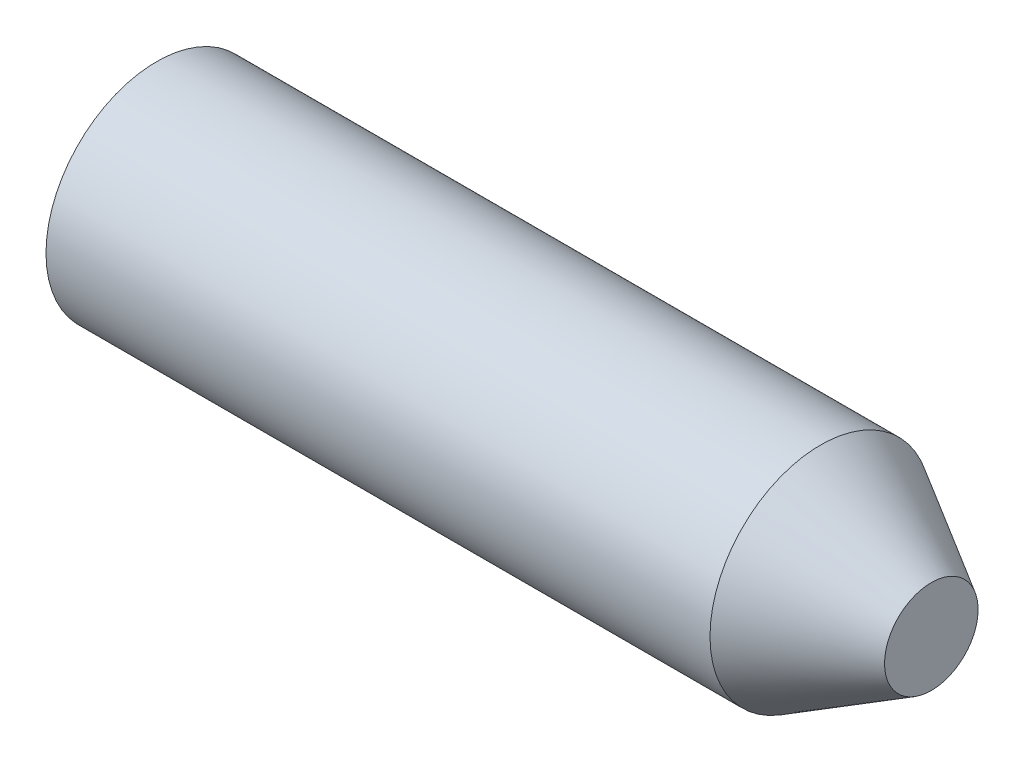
ISO-10303-21;
HEADER;
FILE_DESCRIPTION(('STEP AP214'),'2;1');
FILE_NAME('part.step','',(''),(''),'','','');
FILE_SCHEMA(('AUTOMOTIVE_DESIGN { 1 0 10303 214 1 1 1 1 }'));
ENDSEC;
DATA;
#1=APPLICATION_CONTEXT('core data for automotive mechanical design processes');
#2=APPLICATION_PROTOCOL_DEFINITION('international standard','automotive_design',2000,#1);
#3=PRODUCT_CONTEXT('',#1,'mechanical');
#4=PRODUCT('Part','Part','',(#3));
#5=PRODUCT_RELATED_PRODUCT_CATEGORY('part','',(#4));
#6=PRODUCT_DEFINITION_FORMATION('','',#4);
#7=PRODUCT_DEFINITION_CONTEXT('part definition',#1,'design');
#8=PRODUCT_DEFINITION('design','',#6,#7);
#9=PRODUCT_DEFINITION_SHAPE('','',#8);
#10=(LENGTH_UNIT() NAMED_UNIT(*) SI_UNIT(.MILLI.,.METRE.));
#11=(NAMED_UNIT(*) PLANE_ANGLE_UNIT() SI_UNIT($,.RADIAN.));
#12=(NAMED_UNIT(*) SI_UNIT($,.STERADIAN.) SOLID_ANGLE_UNIT());
#13=UNCERTAINTY_MEASURE_WITH_UNIT(LENGTH_MEASURE(1.E-05),#10,'distance_accuracy_value','');
#14=(GEOMETRIC_REPRESENTATION_CONTEXT(3) GLOBAL_UNCERTAINTY_ASSIGNED_CONTEXT((#13)) GLOBAL_UNIT_ASSIGNED_CONTEXT((#10,
#11,#12)) REPRESENTATION_CONTEXT('',''));
#15=CARTESIAN_POINT('',(0.,0.,0.));
#16=DIRECTION('',(0.,0.,1.));
#17=DIRECTION('',(1.,0.,0.));
#18=AXIS2_PLACEMENT_3D('',#15,#16,#17);
#19=CARTESIAN_POINT('',(0.,20.,0.));
#20=DIRECTION('',(1.,0.,0.));
#21=DIRECTION('',(0.,0.,-1.));
#22=AXIS2_PLACEMENT_3D('',#19,#20,#21);
#23=PLANE('',#22);
#24=CARTESIAN_POINT('',(0.,10.,0.));
#25=DIRECTION('',(-1.,0.,0.));
#26=DIRECTION('',(0.,0.,1.));
#27=AXIS2_PLACEMENT_3D('',#24,#25,#26);
#28=CIRCLE('',#27,7.99999999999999);
#29=CARTESIAN_POINT('',(0.,10.,7.99999999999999));
#30=VERTEX_POINT('',#29);
#31=EDGE_CURVE('E63',#30,#30,#28,.T.);
#32=ORIENTED_EDGE('',*,*,#31,.F.);
#33=EDGE_LOOP('',(#32));
#34=FACE_BOUND('',#33,.T.);
#35=CARTESIAN_POINT('',(0.,10.,0.));
#36=DIRECTION('',(-1.,0.,0.));
#37=DIRECTION('',(0.,0.,1.));
#38=AXIS2_PLACEMENT_3D('',#35,#36,#37);
#39=CIRCLE('',#38,10.);
#40=CARTESIAN_POINT('',(0.,10.,10.));
#41=VERTEX_POINT('',#40);
#42=EDGE_CURVE('E71',#41,#41,#39,.T.);
#43=ORIENTED_EDGE('',*,*,#42,.T.);
#44=EDGE_LOOP('',(#43));
#45=FACE_BOUND('',#44,.T.);
#46=ADVANCED_FACE('F37',(#34,#45),#23,.F.);
#47=CARTESIAN_POINT('',(70.,10.,0.));
#48=DIRECTION('',(-1.,0.,0.));
#49=DIRECTION('',(0.,0.,1.));
#50=AXIS2_PLACEMENT_3D('',#47,#48,#49);
#51=PLANE('',#50);
#52=CARTESIAN_POINT('',(70.,10.,0.));
#53=DIRECTION('',(-1.,0.,0.));
#54=DIRECTION('',(0.,0.,1.));
#55=AXIS2_PLACEMENT_3D('',#52,#53,#54);
#56=CIRCLE('',#55,4.22649730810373);
#57=CARTESIAN_POINT('',(70.,10.,4.22649730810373));
#58=VERTEX_POINT('',#57);
#59=EDGE_CURVE('E48',#58,#58,#56,.T.);
#60=ORIENTED_EDGE('',*,*,#59,.F.);
#61=EDGE_LOOP('',(#60));
#62=FACE_BOUND('',#61,.T.);
#63=ADVANCED_FACE('F81',(#62),#51,.F.);
#64=CARTESIAN_POINT('',(70.,10.,0.));
#65=DIRECTION('',(-1.,0.,0.));
#66=DIRECTION('',(0.,0.,1.));
#67=AXIS2_PLACEMENT_3D('',#64,#65,#66);
#68=CONICAL_SURFACE('',#67,4.22649730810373,0.5235987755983);
#69=CARTESIAN_POINT('',(60.,10.,0.));
#70=DIRECTION('',(-1.,0.,0.));
#71=DIRECTION('',(0.,0.,1.));
#72=AXIS2_PLACEMENT_3D('',#69,#70,#71);
#73=CIRCLE('',#72,10.);
#74=CARTESIAN_POINT('',(60.,10.,10.));
#75=VERTEX_POINT('',#74);
#76=EDGE_CURVE('E74',#75,#75,#73,.T.);
#77=ORIENTED_EDGE('',*,*,#76,.F.);
#78=EDGE_LOOP('',(#77));
#79=FACE_BOUND('',#78,.T.);
#80=ORIENTED_EDGE('',*,*,#59,.T.);
#81=EDGE_LOOP('',(#80));
#82=FACE_BOUND('',#81,.T.);
#83=ADVANCED_FACE('F79',(#79,#82),#68,.T.);
#84=CARTESIAN_POINT('',(0.,10.,0.));
#85=DIRECTION('',(-1.,0.,0.));
#86=DIRECTION('',(0.,0.,1.));
#87=AXIS2_PLACEMENT_3D('',#84,#85,#86);
#88=CYLINDRICAL_SURFACE('',#87,10.);
#89=CARTESIAN_POINT('',(30.,0.137064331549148,-1.64999999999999));
#90=CARTESIAN_POINT('',(29.9079981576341,0.137062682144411,-1.64999629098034));
#91=CARTESIAN_POINT('',(29.8159457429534,0.135763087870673,-1.6422790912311));
#92=CARTESIAN_POINT('',(29.6344227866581,0.130709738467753,-1.61162706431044));
#93=CARTESIAN_POINT('',(29.5449547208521,0.126953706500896,-1.58867811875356));
#94=CARTESIAN_POINT('',(29.3712538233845,0.117424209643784,-1.5282748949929));
#95=CARTESIAN_POINT('',(29.2870167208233,0.111652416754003,-1.49083263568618));
#96=CARTESIAN_POINT('',(29.1260297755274,0.0987437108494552,-1.40253539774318));
#97=CARTESIAN_POINT('',(29.0492790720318,0.0916069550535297,-1.35168196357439));
#98=CARTESIAN_POINT('',(28.9046924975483,0.0766953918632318,-1.2374816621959));
#99=CARTESIAN_POINT('',(28.8369394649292,0.0689156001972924,-1.17403055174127));
#100=CARTESIAN_POINT('',(28.7129908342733,0.0536388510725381,-1.0366612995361));
#101=CARTESIAN_POINT('',(28.6567959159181,0.0461419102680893,-0.962742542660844));
#102=CARTESIAN_POINT('',(28.5572483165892,0.0322228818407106,-0.806000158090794));
#103=CARTESIAN_POINT('',(28.5139726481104,0.0258073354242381,-0.723126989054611));
#104=CARTESIAN_POINT('',(28.4419869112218,0.0148293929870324,-0.551164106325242));
#105=CARTESIAN_POINT('',(28.4132759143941,0.0102668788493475,-0.462074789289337));
#106=CARTESIAN_POINT('',(28.3714876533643,0.00354425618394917,-0.281064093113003));
#107=CARTESIAN_POINT('',(28.3582712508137,0.0013627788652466,-0.189175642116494));
#108=CARTESIAN_POINT('',(28.3474147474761,-0.000425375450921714,-0.00446128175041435));
#109=CARTESIAN_POINT('',(28.3497736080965,-3.22241302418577E-05,0.0883645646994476));
#110=CARTESIAN_POINT('',(28.3698920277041,0.00326764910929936,0.271367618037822));
#111=CARTESIAN_POINT('',(28.3875018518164,0.00614993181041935,0.361561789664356));
#112=CARTESIAN_POINT('',(28.4373866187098,0.0140769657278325,0.537697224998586));
#113=CARTESIAN_POINT('',(28.4696620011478,0.0191217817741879,0.6236383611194));
#114=CARTESIAN_POINT('',(28.5481109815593,0.0308486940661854,0.789274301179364));
#115=CARTESIAN_POINT('',(28.5943464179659,0.0375380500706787,0.868939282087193));
#116=CARTESIAN_POINT('',(28.6993577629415,0.051810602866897,1.01943645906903));
#117=CARTESIAN_POINT('',(28.7581346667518,0.0593938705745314,1.09026795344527));
#118=CARTESIAN_POINT('',(28.8873913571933,0.0747170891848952,1.22197197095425));
#119=CARTESIAN_POINT('',(28.9580019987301,0.0824578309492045,1.28271604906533));
#120=CARTESIAN_POINT('',(29.1084805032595,0.0971362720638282,1.39151469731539));
#121=CARTESIAN_POINT('',(29.1883484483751,0.104073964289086,1.43956915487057));
#122=CARTESIAN_POINT('',(29.355221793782,0.116361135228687,1.5216488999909));
#123=CARTESIAN_POINT('',(29.4422348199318,0.121708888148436,1.5556589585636));
#124=CARTESIAN_POINT('',(29.6208466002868,0.13018192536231,1.60854450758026));
#125=CARTESIAN_POINT('',(29.7124449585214,0.133307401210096,1.62742130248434));
#126=CARTESIAN_POINT('',(29.8964786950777,0.136945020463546,1.64932410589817));
#127=CARTESIAN_POINT('',(29.9888917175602,0.137487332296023,1.65253310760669));
#128=CARTESIAN_POINT('',(30.172934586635,0.135977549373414,1.6434966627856));
#129=CARTESIAN_POINT('',(30.2645644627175,0.133925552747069,1.63125180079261));
#130=CARTESIAN_POINT('',(30.4438602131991,0.127486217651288,1.5918111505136));
#131=CARTESIAN_POINT('',(30.5315470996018,0.123113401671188,1.56470830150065));
#132=CARTESIAN_POINT('',(30.701134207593,0.112537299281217,1.49641841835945));
#133=CARTESIAN_POINT('',(30.783034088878,0.106333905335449,1.45523055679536));
#134=CARTESIAN_POINT('',(30.9395373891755,0.0927254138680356,1.35950711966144));
#135=CARTESIAN_POINT('',(31.0140680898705,0.0853099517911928,1.30485415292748));
#136=CARTESIAN_POINT('',(31.1529660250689,0.0701432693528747,1.18391324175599));
#137=CARTESIAN_POINT('',(31.2173325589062,0.0623920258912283,1.11762449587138));
#138=CARTESIAN_POINT('',(31.3347420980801,0.0473318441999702,0.974483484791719));
#139=CARTESIAN_POINT('',(31.3876631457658,0.0400282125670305,0.897530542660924));
#140=CARTESIAN_POINT('',(31.4798257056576,0.026771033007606,0.735720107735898));
#141=CARTESIAN_POINT('',(31.5190676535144,0.0208174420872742,0.650862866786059));
#142=CARTESIAN_POINT('',(31.5825677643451,0.0109542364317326,0.476016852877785));
#143=CARTESIAN_POINT('',(31.6068900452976,0.00703588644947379,0.386051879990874));
#144=CARTESIAN_POINT('',(31.6400669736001,0.00164775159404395,0.203244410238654));
#145=CARTESIAN_POINT('',(31.6489228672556,0.000177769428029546,0.110402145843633));
#146=CARTESIAN_POINT('',(31.6508803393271,-0.000145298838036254,-0.0743467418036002));
#147=CARTESIAN_POINT('',(31.6441675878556,0.000970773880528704,-0.166251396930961));
#148=CARTESIAN_POINT('',(31.615579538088,0.00563153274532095,-0.347605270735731));
#149=CARTESIAN_POINT('',(31.5937043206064,0.00917620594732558,-0.437054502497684));
#150=CARTESIAN_POINT('',(31.5354829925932,0.0182973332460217,-0.610889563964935));
#151=CARTESIAN_POINT('',(31.4991523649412,0.0238716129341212,-0.695280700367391));
#152=CARTESIAN_POINT('',(31.4130720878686,0.0364430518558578,-0.856798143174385));
#153=CARTESIAN_POINT('',(31.3633218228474,0.0434402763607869,-0.933924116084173));
#154=CARTESIAN_POINT('',(31.2511549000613,0.0581806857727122,-1.07965789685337));
#155=CARTESIAN_POINT('',(31.188602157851,0.065931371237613,-1.14816021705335));
#156=CARTESIAN_POINT('',(31.0528916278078,0.0812528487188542,-1.27376166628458));
#157=CARTESIAN_POINT('',(30.9797313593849,0.0888235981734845,-1.3308581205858));
#158=CARTESIAN_POINT('',(30.8242821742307,0.102984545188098,-1.43238917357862));
#159=CARTESIAN_POINT('',(30.7419336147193,0.109567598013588,-1.47673345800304));
#160=CARTESIAN_POINT('',(30.570881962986,0.120923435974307,-1.55089189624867));
#161=CARTESIAN_POINT('',(30.4821853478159,0.125698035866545,-1.58072062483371));
#162=CARTESIAN_POINT('',(30.3276147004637,0.131832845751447,-1.61849251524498));
#163=CARTESIAN_POINT('',(30.2626786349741,0.133783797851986,-1.63028895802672));
#164=CARTESIAN_POINT('',(30.1318370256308,0.136400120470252,-1.64604396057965));
#165=CARTESIAN_POINT('',(30.065931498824,0.137065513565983,-1.65000265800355));
#166=CARTESIAN_POINT('',(30.,0.137064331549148,-1.64999999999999));
#167=B_SPLINE_CURVE_WITH_KNOTS('',3,(#89,#90,#91,#92,#93,#94,#95,#96,#97,#98,#99,#100,#101,#102,
#103,#104,#105,#106,#107,#108,#109,#110,#111,#112,#113,#114,#115,#116,#117,#118,#119,#120,#121,
#122,#123,#124,#125,#126,#127,#128,#129,#130,#131,#132,#133,#134,#135,#136,#137,#138,#139,#140,
#141,#142,#143,#144,#145,#146,#147,#148,#149,#150,#151,#152,#153,#154,#155,#156,#157,#158,#159,
#160,#161,#162,#163,#164,#165,#166),.UNSPECIFIED.,.T.,.F.,(4,2,2,2,2,2,2,2,2,2,2,2,2,2,2,2,2,2,
2,2,2,2,2,2,2,2,2,2,2,2,2,2,2,2,2,2,2,2,4),(0.,0.275764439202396,0.551784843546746,
0.82757684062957,1.10333709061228,1.38148219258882,1.65964364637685,1.93943156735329,
2.21920165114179,2.49643973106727,2.77365932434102,3.04818762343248,3.32272415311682,
3.59849508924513,3.8742879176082,4.15336037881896,4.43243531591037,4.71181207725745,
4.99116475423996,5.26724677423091,5.54331835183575,5.81768243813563,6.09206264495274,
6.36892529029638,6.64580701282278,6.9255076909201,7.20519946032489,7.48368066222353,
7.76213942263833,8.03729441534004,8.31244794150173,8.58730754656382,8.86217976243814,
9.14014153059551,9.41816840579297,9.69811840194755,9.97778672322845,10.175411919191,
10.3730336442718),.UNSPECIFIED.);
#168=CARTESIAN_POINT('',(30.,0.137064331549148,-1.64999999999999));
#169=VERTEX_POINT('',#168);
#170=EDGE_CURVE('E11',#169,#169,#167,.T.);
#171=ORIENTED_EDGE('',*,*,#170,.T.);
#172=EDGE_LOOP('',(#171));
#173=FACE_BOUND('',#172,.T.);
#174=ORIENTED_EDGE('',*,*,#42,.F.);
#175=EDGE_LOOP('',(#174));
#176=FACE_BOUND('',#175,.T.);
#177=ORIENTED_EDGE('',*,*,#76,.T.);
#178=EDGE_LOOP('',(#177));
#179=FACE_BOUND('',#178,.T.);
#180=ADVANCED_FACE('F87',(#173,#176,#179),#88,.T.);
#181=CARTESIAN_POINT('',(15.,10.,0.));
#182=DIRECTION('',(-1.,0.,0.));
#183=DIRECTION('',(0.,0.,1.));
#184=AXIS2_PLACEMENT_3D('',#181,#182,#183);
#185=CONICAL_SURFACE('',#184,8.,1.02974425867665);
#186=CARTESIAN_POINT('',(19.8068849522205,9.99999999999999,0.));
#187=VERTEX_POINT('',#186);
#188=VERTEX_LOOP('',#187);
#189=FACE_BOUND('',#188,.T.);
#190=CARTESIAN_POINT('',(15.,10.,0.));
#191=DIRECTION('',(-1.,0.,0.));
#192=DIRECTION('',(0.,0.,1.));
#193=AXIS2_PLACEMENT_3D('',#190,#191,#192);
#194=CIRCLE('',#193,8.);
#195=CARTESIAN_POINT('',(15.,10.,8.));
#196=VERTEX_POINT('',#195);
#197=EDGE_CURVE('E66',#196,#196,#194,.T.);
#198=ORIENTED_EDGE('',*,*,#197,.T.);
#199=EDGE_LOOP('',(#198));
#200=FACE_BOUND('',#199,.T.);
#201=ADVANCED_FACE('F94',(#189,#200),#185,.F.);
#202=CARTESIAN_POINT('',(0.,10.,0.));
#203=DIRECTION('',(-1.,0.,0.));
#204=DIRECTION('',(0.,0.,1.));
#205=AXIS2_PLACEMENT_3D('',#202,#203,#204);
#206=CYLINDRICAL_SURFACE('',#205,7.99999999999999);
#207=ORIENTED_EDGE('',*,*,#197,.F.);
#208=EDGE_LOOP('',(#207));
#209=FACE_BOUND('',#208,.T.);
#210=ORIENTED_EDGE('',*,*,#31,.T.);
#211=EDGE_LOOP('',(#210));
#212=FACE_BOUND('',#211,.T.);
#213=ADVANCED_FACE('F98',(#209,#212),#206,.F.);
#214=CARTESIAN_POINT('',(30.,0.,0.));
#215=DIRECTION('',(0.,-1.,0.));
#216=DIRECTION('',(0.,0.,-1.));
#217=AXIS2_PLACEMENT_3D('',#214,#215,#216);
#218=CYLINDRICAL_SURFACE('',#217,1.64999999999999);
#219=CARTESIAN_POINT('',(30.,12.1,0.));
#220=DIRECTION('',(0.,-1.,0.));
#221=DIRECTION('',(0.,0.,-1.));
#222=AXIS2_PLACEMENT_3D('',#219,#220,#221);
#223=CIRCLE('',#222,1.64999999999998);
#224=CARTESIAN_POINT('',(30.,12.1,-1.64999999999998));
#225=VERTEX_POINT('',#224);
#226=EDGE_CURVE('E61',#225,#225,#223,.T.);
#227=ORIENTED_EDGE('',*,*,#226,.F.);
#228=EDGE_LOOP('',(#227));
#229=FACE_BOUND('',#228,.T.);
#230=ORIENTED_EDGE('',*,*,#170,.F.);
#231=EDGE_LOOP('',(#230));
#232=FACE_BOUND('',#231,.T.);
#233=ADVANCED_FACE('F57',(#229,#232),#218,.F.);
#234=CARTESIAN_POINT('',(30.,12.1,0.));
#235=DIRECTION('',(0.,-1.,0.));
#236=DIRECTION('',(0.,0.,-1.));
#237=AXIS2_PLACEMENT_3D('',#234,#235,#236);
#238=CONICAL_SURFACE('',#237,1.64999999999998,1.02974425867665);
#239=CARTESIAN_POINT('',(30.,13.0914200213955,0.));
#240=VERTEX_POINT('',#239);
#241=VERTEX_LOOP('',#240);
#242=FACE_BOUND('',#241,.T.);
#243=ORIENTED_EDGE('',*,*,#226,.T.);
#244=EDGE_LOOP('',(#243));
#245=FACE_BOUND('',#244,.T.);
#246=ADVANCED_FACE('F54',(#242,#245),#238,.F.);
#247=CLOSED_SHELL('',(#46,#63,#83,#180,#201,#213,#233,#246));
#248=MANIFOLD_SOLID_BREP('B2',#247);
#249=ADVANCED_BREP_SHAPE_REPRESENTATION('',(#18,#248),#14);
#250=SHAPE_DEFINITION_REPRESENTATION(#9,#249);
ENDSEC;
END-ISO-10303-21;
